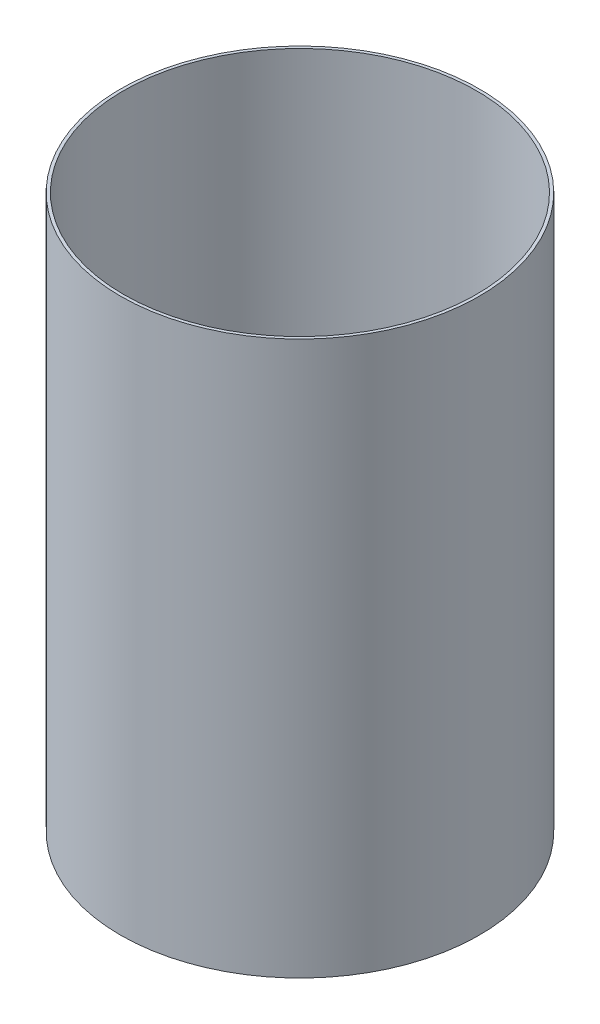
ISO-10303-21;
HEADER;
FILE_DESCRIPTION(('STEP AP214'),'2;1');
FILE_NAME('part.step','',(''),(''),'','','');
FILE_SCHEMA(('AUTOMOTIVE_DESIGN { 1 0 10303 214 1 1 1 1 }'));
ENDSEC;
DATA;
#1=APPLICATION_CONTEXT('core data for automotive mechanical design processes');
#2=APPLICATION_PROTOCOL_DEFINITION('international standard','automotive_design',2000,#1);
#3=PRODUCT_CONTEXT('',#1,'mechanical');
#4=PRODUCT('Part','Part','',(#3));
#5=PRODUCT_RELATED_PRODUCT_CATEGORY('part','',(#4));
#6=PRODUCT_DEFINITION_FORMATION('','',#4);
#7=PRODUCT_DEFINITION_CONTEXT('part definition',#1,'design');
#8=PRODUCT_DEFINITION('design','',#6,#7);
#9=PRODUCT_DEFINITION_SHAPE('','',#8);
#10=(LENGTH_UNIT() NAMED_UNIT(*) SI_UNIT(.MILLI.,.METRE.));
#11=(NAMED_UNIT(*) PLANE_ANGLE_UNIT() SI_UNIT($,.RADIAN.));
#12=(NAMED_UNIT(*) SI_UNIT($,.STERADIAN.) SOLID_ANGLE_UNIT());
#13=UNCERTAINTY_MEASURE_WITH_UNIT(LENGTH_MEASURE(1.E-05),#10,'distance_accuracy_value','');
#14=(GEOMETRIC_REPRESENTATION_CONTEXT(3) GLOBAL_UNCERTAINTY_ASSIGNED_CONTEXT((#13)) GLOBAL_UNIT_ASSIGNED_CONTEXT((#10,
#11,#12)) REPRESENTATION_CONTEXT('',''));
#15=CARTESIAN_POINT('',(0.,0.,0.));
#16=DIRECTION('',(0.,0.,1.));
#17=DIRECTION('',(1.,0.,0.));
#18=AXIS2_PLACEMENT_3D('',#15,#16,#17);
#19=CARTESIAN_POINT('',(0.,17.,-6.));
#20=DIRECTION('',(0.,-1.,0.));
#21=DIRECTION('',(0.,0.,-1.));
#22=AXIS2_PLACEMENT_3D('',#19,#20,#21);
#23=PLANE('',#22);
#24=CARTESIAN_POINT('',(0.,17.,0.));
#25=DIRECTION('',(0.,1.,0.));
#26=DIRECTION('',(0.,0.,1.));
#27=AXIS2_PLACEMENT_3D('',#24,#25,#26);
#28=CIRCLE('',#27,5.9);
#29=CARTESIAN_POINT('',(0.,17.,5.9));
#30=VERTEX_POINT('',#29);
#31=EDGE_CURVE('E10',#30,#30,#28,.T.);
#32=ORIENTED_EDGE('',*,*,#31,.F.);
#33=EDGE_LOOP('',(#32));
#34=FACE_BOUND('',#33,.T.);
#35=CARTESIAN_POINT('',(0.,17.,0.));
#36=DIRECTION('',(0.,1.,0.));
#37=DIRECTION('',(0.,0.,1.));
#38=AXIS2_PLACEMENT_3D('',#35,#36,#37);
#39=CIRCLE('',#38,6.);
#40=CARTESIAN_POINT('',(0.,17.,6.));
#41=VERTEX_POINT('',#40);
#42=EDGE_CURVE('E53',#41,#41,#39,.T.);
#43=ORIENTED_EDGE('',*,*,#42,.T.);
#44=EDGE_LOOP('',(#43));
#45=FACE_BOUND('',#44,.T.);
#46=ADVANCED_FACE('F31',(#34,#45),#23,.F.);
#47=CARTESIAN_POINT('',(0.,37.0950169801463,0.));
#48=DIRECTION('',(0.,1.,0.));
#49=DIRECTION('',(0.,0.,1.));
#50=AXIS2_PLACEMENT_3D('',#47,#48,#49);
#51=CYLINDRICAL_SURFACE('',#50,5.9);
#52=CARTESIAN_POINT('',(0.,0.,0.));
#53=DIRECTION('',(0.,1.,0.));
#54=DIRECTION('',(0.,0.,1.));
#55=AXIS2_PLACEMENT_3D('',#52,#53,#54);
#56=CIRCLE('',#55,5.9);
#57=CARTESIAN_POINT('',(0.,0.,5.9));
#58=VERTEX_POINT('',#57);
#59=EDGE_CURVE('E37',#58,#58,#56,.T.);
#60=ORIENTED_EDGE('',*,*,#59,.F.);
#61=EDGE_LOOP('',(#60));
#62=FACE_BOUND('',#61,.T.);
#63=ORIENTED_EDGE('',*,*,#31,.T.);
#64=EDGE_LOOP('',(#63));
#65=FACE_BOUND('',#64,.T.);
#66=ADVANCED_FACE('F78',(#62,#65),#51,.F.);
#67=CARTESIAN_POINT('',(0.,0.,-5.9));
#68=DIRECTION('',(0.,-1.,0.));
#69=DIRECTION('',(0.,0.,-1.));
#70=AXIS2_PLACEMENT_3D('',#67,#68,#69);
#71=PLANE('',#70);
#72=CARTESIAN_POINT('',(0.,0.,0.));
#73=DIRECTION('',(0.,1.,0.));
#74=DIRECTION('',(0.,0.,1.));
#75=AXIS2_PLACEMENT_3D('',#72,#73,#74);
#76=CIRCLE('',#75,4.);
#77=CARTESIAN_POINT('',(0.,0.,4.));
#78=VERTEX_POINT('',#77);
#79=EDGE_CURVE('E41',#78,#78,#76,.T.);
#80=ORIENTED_EDGE('',*,*,#79,.F.);
#81=EDGE_LOOP('',(#80));
#82=FACE_BOUND('',#81,.T.);
#83=ORIENTED_EDGE('',*,*,#59,.T.);
#84=EDGE_LOOP('',(#83));
#85=FACE_BOUND('',#84,.T.);
#86=ADVANCED_FACE('F73',(#82,#85),#71,.F.);
#87=CARTESIAN_POINT('',(0.,37.0950169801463,0.));
#88=DIRECTION('',(0.,1.,0.));
#89=DIRECTION('',(0.,0.,1.));
#90=AXIS2_PLACEMENT_3D('',#87,#88,#89);
#91=CYLINDRICAL_SURFACE('',#90,4.);
#92=CARTESIAN_POINT('',(0.,-1.5,0.));
#93=DIRECTION('',(0.,1.,0.));
#94=DIRECTION('',(0.,0.,1.));
#95=AXIS2_PLACEMENT_3D('',#92,#93,#94);
#96=CIRCLE('',#95,4.);
#97=CARTESIAN_POINT('',(0.,-1.5,4.));
#98=VERTEX_POINT('',#97);
#99=EDGE_CURVE('E45',#98,#98,#96,.T.);
#100=ORIENTED_EDGE('',*,*,#99,.F.);
#101=EDGE_LOOP('',(#100));
#102=FACE_BOUND('',#101,.T.);
#103=ORIENTED_EDGE('',*,*,#79,.T.);
#104=EDGE_LOOP('',(#103));
#105=FACE_BOUND('',#104,.T.);
#106=ADVANCED_FACE('F67',(#102,#105),#91,.F.);
#107=CARTESIAN_POINT('',(0.,-1.5,-4.));
#108=DIRECTION('',(0.,1.,0.));
#109=DIRECTION('',(0.,0.,1.));
#110=AXIS2_PLACEMENT_3D('',#107,#108,#109);
#111=PLANE('',#110);
#112=CARTESIAN_POINT('',(0.,-1.5,0.));
#113=DIRECTION('',(0.,1.,0.));
#114=DIRECTION('',(0.,0.,1.));
#115=AXIS2_PLACEMENT_3D('',#112,#113,#114);
#116=CIRCLE('',#115,6.);
#117=CARTESIAN_POINT('',(0.,-1.5,6.));
#118=VERTEX_POINT('',#117);
#119=EDGE_CURVE('E50',#118,#118,#116,.T.);
#120=ORIENTED_EDGE('',*,*,#119,.F.);
#121=EDGE_LOOP('',(#120));
#122=FACE_BOUND('',#121,.T.);
#123=ORIENTED_EDGE('',*,*,#99,.T.);
#124=EDGE_LOOP('',(#123));
#125=FACE_BOUND('',#124,.T.);
#126=ADVANCED_FACE('F61',(#122,#125),#111,.F.);
#127=CARTESIAN_POINT('',(0.,37.0950169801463,0.));
#128=DIRECTION('',(0.,1.,0.));
#129=DIRECTION('',(0.,0.,1.));
#130=AXIS2_PLACEMENT_3D('',#127,#128,#129);
#131=CYLINDRICAL_SURFACE('',#130,6.);
#132=ORIENTED_EDGE('',*,*,#42,.F.);
#133=EDGE_LOOP('',(#132));
#134=FACE_BOUND('',#133,.T.);
#135=ORIENTED_EDGE('',*,*,#119,.T.);
#136=EDGE_LOOP('',(#135));
#137=FACE_BOUND('',#136,.T.);
#138=ADVANCED_FACE('F58',(#134,#137),#131,.T.);
#139=CLOSED_SHELL('',(#46,#66,#86,#106,#126,#138));
#140=MANIFOLD_SOLID_BREP('B2',#139);
#141=ADVANCED_BREP_SHAPE_REPRESENTATION('',(#18,#140),#14);
#142=SHAPE_DEFINITION_REPRESENTATION(#9,#141);
ENDSEC;
END-ISO-10303-21;
